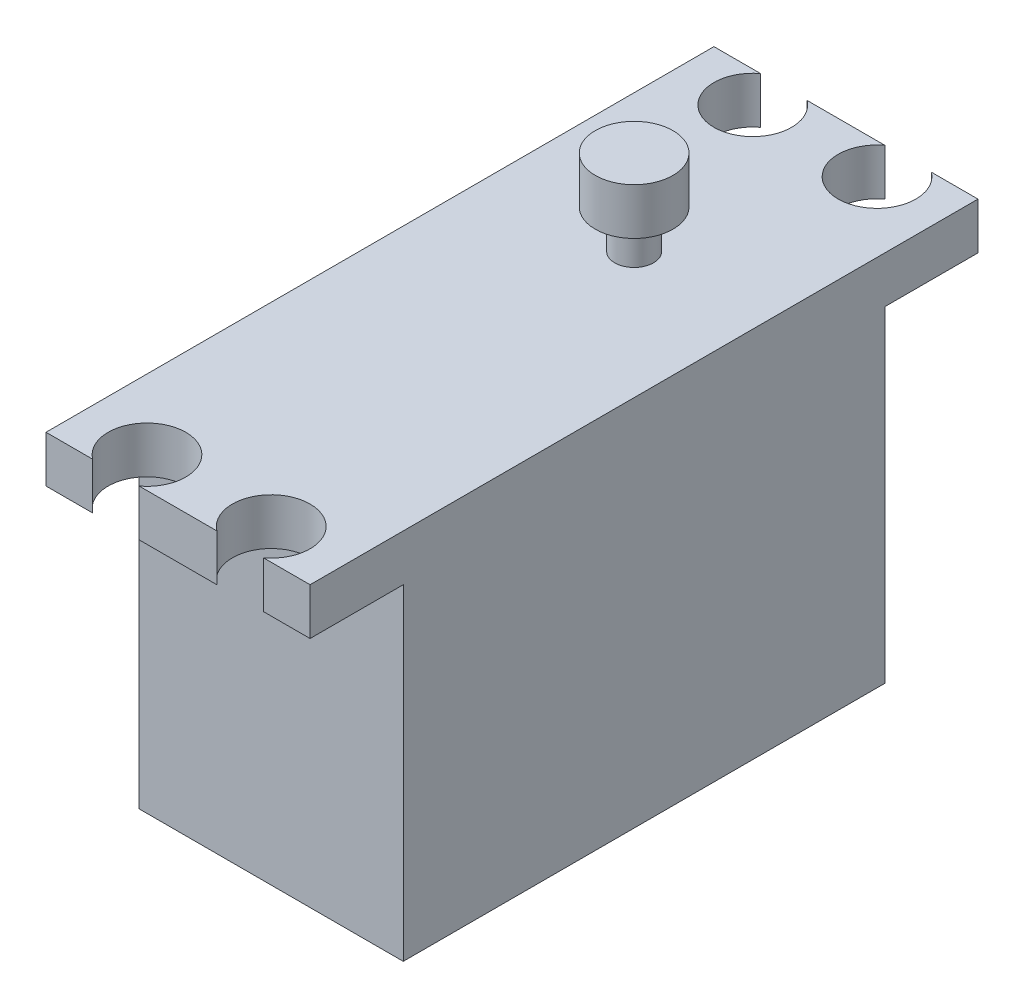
ISO-10303-21;
HEADER;
FILE_DESCRIPTION(('STEP AP214'),'2;1');
FILE_NAME('part.step','',(''),(''),'','','');
FILE_SCHEMA(('AUTOMOTIVE_DESIGN { 1 0 10303 214 1 1 1 1 }'));
ENDSEC;
DATA;
#1=APPLICATION_CONTEXT('core data for automotive mechanical design processes');
#2=APPLICATION_PROTOCOL_DEFINITION('international standard','automotive_design',2000,#1);
#3=PRODUCT_CONTEXT('',#1,'mechanical');
#4=PRODUCT('Part','Part','',(#3));
#5=PRODUCT_RELATED_PRODUCT_CATEGORY('part','',(#4));
#6=PRODUCT_DEFINITION_FORMATION('','',#4);
#7=PRODUCT_DEFINITION_CONTEXT('part definition',#1,'design');
#8=PRODUCT_DEFINITION('design','',#6,#7);
#9=PRODUCT_DEFINITION_SHAPE('','',#8);
#10=(LENGTH_UNIT() NAMED_UNIT(*) SI_UNIT(.MILLI.,.METRE.));
#11=(NAMED_UNIT(*) PLANE_ANGLE_UNIT() SI_UNIT($,.RADIAN.));
#12=(NAMED_UNIT(*) SI_UNIT($,.STERADIAN.) SOLID_ANGLE_UNIT());
#13=UNCERTAINTY_MEASURE_WITH_UNIT(LENGTH_MEASURE(1.E-05),#10,'distance_accuracy_value','');
#14=(GEOMETRIC_REPRESENTATION_CONTEXT(3) GLOBAL_UNCERTAINTY_ASSIGNED_CONTEXT((#13)) GLOBAL_UNIT_ASSIGNED_CONTEXT((#10,
#11,#12)) REPRESENTATION_CONTEXT('',''));
#15=CARTESIAN_POINT('',(0.,0.,0.));
#16=DIRECTION('',(0.,0.,1.));
#17=DIRECTION('',(1.,0.,0.));
#18=AXIS2_PLACEMENT_3D('',#15,#16,#17);
#19=CARTESIAN_POINT('',(8.86224165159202,29.5,8.));
#20=DIRECTION('',(0.,-1.,0.));
#21=DIRECTION('',(0.,0.,-1.));
#22=AXIS2_PLACEMENT_3D('',#19,#20,#21);
#23=CYLINDRICAL_SURFACE('',#22,1.25);
#24=CARTESIAN_POINT('',(8.86224165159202,24.,8.));
#25=DIRECTION('',(0.,1.,0.));
#26=DIRECTION('',(0.,0.,1.));
#27=AXIS2_PLACEMENT_3D('',#24,#25,#26);
#28=CIRCLE('',#27,1.25);
#29=CARTESIAN_POINT('',(8.86224165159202,24.,9.25));
#30=VERTEX_POINT('',#29);
#31=EDGE_CURVE('E298',#30,#30,#28,.T.);
#32=ORIENTED_EDGE('',*,*,#31,.T.);
#33=EDGE_LOOP('',(#32));
#34=FACE_BOUND('',#33,.T.);
#35=CARTESIAN_POINT('',(8.86224165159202,26.5,8.));
#36=DIRECTION('',(0.,1.,0.));
#37=DIRECTION('',(0.,0.,1.));
#38=AXIS2_PLACEMENT_3D('',#35,#36,#37);
#39=CIRCLE('',#38,1.25);
#40=CARTESIAN_POINT('',(8.86224165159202,26.5,9.25));
#41=VERTEX_POINT('',#40);
#42=EDGE_CURVE('E11',#41,#41,#39,.T.);
#43=ORIENTED_EDGE('',*,*,#42,.F.);
#44=EDGE_LOOP('',(#43));
#45=FACE_BOUND('',#44,.T.);
#46=ADVANCED_FACE('F32',(#34,#45),#23,.T.);
#47=CARTESIAN_POINT('',(17.,24.,-6.));
#48=DIRECTION('',(0.,0.,1.));
#49=DIRECTION('',(1.,0.,0.));
#50=AXIS2_PLACEMENT_3D('',#47,#48,#49);
#51=PLANE('',#50);
#52=DIRECTION('',(-1.,0.,0.));
#53=VECTOR('',#52,1.);
#54=CARTESIAN_POINT('',(17.,24.,-6.));
#55=LINE('',#54,#53);
#56=CARTESIAN_POINT('',(11.,24.,-6.));
#57=VERTEX_POINT('',#56);
#58=CARTESIAN_POINT('',(6.00000000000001,24.,-6.));
#59=VERTEX_POINT('',#58);
#60=EDGE_CURVE('E161',#57,#59,#55,.T.);
#61=ORIENTED_EDGE('',*,*,#60,.F.);
#62=DIRECTION('',(0.,-1.,0.));
#63=VECTOR('',#62,1.);
#64=CARTESIAN_POINT('',(11.,24.,-6.));
#65=LINE('',#64,#63);
#66=CARTESIAN_POINT('',(11.,21.,-6.));
#67=VERTEX_POINT('',#66);
#68=EDGE_CURVE('E289',#57,#67,#65,.T.);
#69=ORIENTED_EDGE('',*,*,#68,.T.);
#70=DIRECTION('',(-1.,0.,0.));
#71=VECTOR('',#70,1.);
#72=CARTESIAN_POINT('',(17.,21.,-6.));
#73=LINE('',#72,#71);
#74=CARTESIAN_POINT('',(6.00000000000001,21.,-6.));
#75=VERTEX_POINT('',#74);
#76=EDGE_CURVE('E163',#67,#75,#73,.T.);
#77=ORIENTED_EDGE('',*,*,#76,.T.);
#78=DIRECTION('',(0.,-1.,0.));
#79=VECTOR('',#78,1.);
#80=CARTESIAN_POINT('',(6.00000000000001,24.,-6.));
#81=LINE('',#80,#79);
#82=EDGE_CURVE('E147',#75,#59,#81,.F.);
#83=ORIENTED_EDGE('',*,*,#82,.T.);
#84=EDGE_LOOP('',(#61,#69,#77,#83));
#85=FACE_BOUND('',#84,.T.);
#86=ADVANCED_FACE('F159',(#85),#51,.F.);
#87=CARTESIAN_POINT('',(3.,24.,-6.));
#88=VERTEX_POINT('',#87);
#89=CARTESIAN_POINT('',(0.,24.,-6.));
#90=VERTEX_POINT('',#89);
#91=EDGE_CURVE('E170',#88,#90,#55,.T.);
#92=ORIENTED_EDGE('',*,*,#91,.F.);
#93=DIRECTION('',(0.,-1.,0.));
#94=VECTOR('',#93,1.);
#95=CARTESIAN_POINT('',(3.,24.,-6.));
#96=LINE('',#95,#94);
#97=CARTESIAN_POINT('',(3.,21.,-6.));
#98=VERTEX_POINT('',#97);
#99=EDGE_CURVE('E150',#88,#98,#96,.T.);
#100=ORIENTED_EDGE('',*,*,#99,.T.);
#101=CARTESIAN_POINT('',(0.,21.,-6.));
#102=VERTEX_POINT('',#101);
#103=EDGE_CURVE('E187',#98,#102,#73,.T.);
#104=ORIENTED_EDGE('',*,*,#103,.T.);
#105=DIRECTION('',(0.,-1.,0.));
#106=VECTOR('',#105,1.);
#107=CARTESIAN_POINT('',(0.,24.,-6.));
#108=LINE('',#107,#106);
#109=EDGE_CURVE('E206',#90,#102,#108,.T.);
#110=ORIENTED_EDGE('',*,*,#109,.F.);
#111=EDGE_LOOP('',(#92,#100,#104,#110));
#112=FACE_BOUND('',#111,.T.);
#113=ADVANCED_FACE('F338',(#112),#51,.F.);
#114=CARTESIAN_POINT('',(0.,24.,37.));
#115=DIRECTION('',(0.,0.,-1.));
#116=DIRECTION('',(-1.,0.,0.));
#117=AXIS2_PLACEMENT_3D('',#114,#115,#116);
#118=PLANE('',#117);
#119=DIRECTION('',(1.,0.,0.));
#120=VECTOR('',#119,1.);
#121=CARTESIAN_POINT('',(0.,24.,37.));
#122=LINE('',#121,#120);
#123=CARTESIAN_POINT('',(5.99999999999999,24.,37.));
#124=VERTEX_POINT('',#123);
#125=CARTESIAN_POINT('',(11.,24.,37.));
#126=VERTEX_POINT('',#125);
#127=EDGE_CURVE('E183',#124,#126,#122,.T.);
#128=ORIENTED_EDGE('',*,*,#127,.F.);
#129=DIRECTION('',(0.,-1.,0.));
#130=VECTOR('',#129,1.);
#131=CARTESIAN_POINT('',(5.99999999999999,24.,37.));
#132=LINE('',#131,#130);
#133=CARTESIAN_POINT('',(5.99999999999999,21.,37.));
#134=VERTEX_POINT('',#133);
#135=EDGE_CURVE('E55',#124,#134,#132,.T.);
#136=ORIENTED_EDGE('',*,*,#135,.T.);
#137=DIRECTION('',(1.,0.,0.));
#138=VECTOR('',#137,1.);
#139=CARTESIAN_POINT('',(0.,21.,37.));
#140=LINE('',#139,#138);
#141=CARTESIAN_POINT('',(11.,21.,37.));
#142=VERTEX_POINT('',#141);
#143=EDGE_CURVE('E200',#134,#142,#140,.T.);
#144=ORIENTED_EDGE('',*,*,#143,.T.);
#145=DIRECTION('',(0.,-1.,0.));
#146=VECTOR('',#145,1.);
#147=CARTESIAN_POINT('',(11.,24.,37.));
#148=LINE('',#147,#146);
#149=EDGE_CURVE('E286',#142,#126,#148,.F.);
#150=ORIENTED_EDGE('',*,*,#149,.T.);
#151=EDGE_LOOP('',(#128,#136,#144,#150));
#152=FACE_BOUND('',#151,.T.);
#153=ADVANCED_FACE('F360',(#152),#118,.F.);
#154=CARTESIAN_POINT('',(14.,24.,37.));
#155=VERTEX_POINT('',#154);
#156=CARTESIAN_POINT('',(17.,24.,37.));
#157=VERTEX_POINT('',#156);
#158=EDGE_CURVE('E178',#155,#157,#122,.T.);
#159=ORIENTED_EDGE('',*,*,#158,.F.);
#160=DIRECTION('',(0.,-1.,0.));
#161=VECTOR('',#160,1.);
#162=CARTESIAN_POINT('',(14.,24.,37.));
#163=LINE('',#162,#161);
#164=CARTESIAN_POINT('',(14.,21.,37.));
#165=VERTEX_POINT('',#164);
#166=EDGE_CURVE('E47',#155,#165,#163,.T.);
#167=ORIENTED_EDGE('',*,*,#166,.T.);
#168=CARTESIAN_POINT('',(17.,21.,37.));
#169=VERTEX_POINT('',#168);
#170=EDGE_CURVE('E196',#165,#169,#140,.T.);
#171=ORIENTED_EDGE('',*,*,#170,.T.);
#172=DIRECTION('',(0.,-1.,0.));
#173=VECTOR('',#172,1.);
#174=CARTESIAN_POINT('',(17.,24.,37.));
#175=LINE('',#174,#173);
#176=EDGE_CURVE('E182',#157,#169,#175,.T.);
#177=ORIENTED_EDGE('',*,*,#176,.F.);
#178=EDGE_LOOP('',(#159,#167,#171,#177));
#179=FACE_BOUND('',#178,.T.);
#180=ADVANCED_FACE('F361',(#179),#118,.F.);
#181=CARTESIAN_POINT('',(17.,21.,0.));
#182=DIRECTION('',(0.,0.,1.));
#183=DIRECTION('',(1.,0.,0.));
#184=AXIS2_PLACEMENT_3D('',#181,#182,#183);
#185=PLANE('',#184);
#186=DIRECTION('',(-1.,0.,0.));
#187=VECTOR('',#186,1.);
#188=CARTESIAN_POINT('',(17.,0.,0.));
#189=LINE('',#188,#187);
#190=CARTESIAN_POINT('',(17.,0.,0.));
#191=VERTEX_POINT('',#190);
#192=CARTESIAN_POINT('',(0.,0.,0.));
#193=VERTEX_POINT('',#192);
#194=EDGE_CURVE('E212',#191,#193,#189,.T.);
#195=ORIENTED_EDGE('',*,*,#194,.T.);
#196=DIRECTION('',(0.,-1.,0.));
#197=VECTOR('',#196,1.);
#198=CARTESIAN_POINT('',(0.,21.,0.));
#199=LINE('',#198,#197);
#200=CARTESIAN_POINT('',(0.,21.,0.));
#201=VERTEX_POINT('',#200);
#202=EDGE_CURVE('E40',#201,#193,#199,.T.);
#203=ORIENTED_EDGE('',*,*,#202,.F.);
#204=DIRECTION('',(-1.,0.,0.));
#205=VECTOR('',#204,1.);
#206=CARTESIAN_POINT('',(17.,21.,0.));
#207=LINE('',#206,#205);
#208=CARTESIAN_POINT('',(17.,21.,0.));
#209=VERTEX_POINT('',#208);
#210=EDGE_CURVE('E213',#209,#201,#207,.T.);
#211=ORIENTED_EDGE('',*,*,#210,.F.);
#212=DIRECTION('',(0.,-1.,0.));
#213=VECTOR('',#212,1.);
#214=CARTESIAN_POINT('',(17.,21.,0.));
#215=LINE('',#214,#213);
#216=EDGE_CURVE('E220',#209,#191,#215,.T.);
#217=ORIENTED_EDGE('',*,*,#216,.T.);
#218=EDGE_LOOP('',(#195,#203,#211,#217));
#219=FACE_BOUND('',#218,.T.);
#220=ADVANCED_FACE('F34',(#219),#185,.F.);
#221=CARTESIAN_POINT('',(0.,21.,0.));
#222=DIRECTION('',(1.,0.,0.));
#223=DIRECTION('',(0.,0.,-1.));
#224=AXIS2_PLACEMENT_3D('',#221,#222,#223);
#225=PLANE('',#224);
#226=DIRECTION('',(0.,0.,1.));
#227=VECTOR('',#226,1.);
#228=CARTESIAN_POINT('',(0.,0.,0.));
#229=LINE('',#228,#227);
#230=CARTESIAN_POINT('',(0.,0.,31.));
#231=VERTEX_POINT('',#230);
#232=EDGE_CURVE('E223',#193,#231,#229,.T.);
#233=ORIENTED_EDGE('',*,*,#232,.T.);
#234=DIRECTION('',(0.,-1.,0.));
#235=VECTOR('',#234,1.);
#236=CARTESIAN_POINT('',(0.,21.,31.));
#237=LINE('',#236,#235);
#238=CARTESIAN_POINT('',(0.,21.,31.));
#239=VERTEX_POINT('',#238);
#240=EDGE_CURVE('E233',#239,#231,#237,.T.);
#241=ORIENTED_EDGE('',*,*,#240,.F.);
#242=DIRECTION('',(0.,0.,1.));
#243=VECTOR('',#242,1.);
#244=CARTESIAN_POINT('',(0.,21.,-6.));
#245=LINE('',#244,#243);
#246=CARTESIAN_POINT('',(0.,21.,37.));
#247=VERTEX_POINT('',#246);
#248=EDGE_CURVE('E192',#239,#247,#245,.T.);
#249=ORIENTED_EDGE('',*,*,#248,.T.);
#250=DIRECTION('',(0.,-1.,0.));
#251=VECTOR('',#250,1.);
#252=CARTESIAN_POINT('',(0.,24.,37.));
#253=LINE('',#252,#251);
#254=CARTESIAN_POINT('',(0.,24.,37.));
#255=VERTEX_POINT('',#254);
#256=EDGE_CURVE('E203',#255,#247,#253,.T.);
#257=ORIENTED_EDGE('',*,*,#256,.F.);
#258=DIRECTION('',(0.,0.,1.));
#259=VECTOR('',#258,1.);
#260=CARTESIAN_POINT('',(0.,24.,-6.));
#261=LINE('',#260,#259);
#262=EDGE_CURVE('E172',#90,#255,#261,.T.);
#263=ORIENTED_EDGE('',*,*,#262,.F.);
#264=ORIENTED_EDGE('',*,*,#109,.T.);
#265=EDGE_CURVE('E193',#102,#201,#245,.T.);
#266=ORIENTED_EDGE('',*,*,#265,.T.);
#267=ORIENTED_EDGE('',*,*,#202,.T.);
#268=EDGE_LOOP('',(#233,#241,#249,#257,#263,#264,#266,#267));
#269=FACE_BOUND('',#268,.T.);
#270=ADVANCED_FACE('F237',(#269),#225,.F.);
#271=CARTESIAN_POINT('',(0.,21.,31.));
#272=DIRECTION('',(0.,0.,-1.));
#273=DIRECTION('',(-1.,0.,0.));
#274=AXIS2_PLACEMENT_3D('',#271,#272,#273);
#275=PLANE('',#274);
#276=DIRECTION('',(1.,0.,0.));
#277=VECTOR('',#276,1.);
#278=CARTESIAN_POINT('',(0.,0.,31.));
#279=LINE('',#278,#277);
#280=CARTESIAN_POINT('',(17.,0.,31.));
#281=VERTEX_POINT('',#280);
#282=EDGE_CURVE('E225',#231,#281,#279,.T.);
#283=ORIENTED_EDGE('',*,*,#282,.T.);
#284=DIRECTION('',(0.,-1.,0.));
#285=VECTOR('',#284,1.);
#286=CARTESIAN_POINT('',(17.,21.,31.));
#287=LINE('',#286,#285);
#288=CARTESIAN_POINT('',(17.,21.,31.));
#289=VERTEX_POINT('',#288);
#290=EDGE_CURVE('E230',#289,#281,#287,.T.);
#291=ORIENTED_EDGE('',*,*,#290,.F.);
#292=DIRECTION('',(1.,0.,0.));
#293=VECTOR('',#292,1.);
#294=CARTESIAN_POINT('',(0.,21.,31.));
#295=LINE('',#294,#293);
#296=EDGE_CURVE('E216',#239,#289,#295,.T.);
#297=ORIENTED_EDGE('',*,*,#296,.F.);
#298=ORIENTED_EDGE('',*,*,#240,.T.);
#299=EDGE_LOOP('',(#283,#291,#297,#298));
#300=FACE_BOUND('',#299,.T.);
#301=ADVANCED_FACE('F247',(#300),#275,.F.);
#302=CARTESIAN_POINT('',(17.,21.,31.));
#303=DIRECTION('',(-1.,0.,0.));
#304=DIRECTION('',(0.,0.,1.));
#305=AXIS2_PLACEMENT_3D('',#302,#303,#304);
#306=PLANE('',#305);
#307=DIRECTION('',(0.,0.,-1.));
#308=VECTOR('',#307,1.);
#309=CARTESIAN_POINT('',(17.,0.,31.));
#310=LINE('',#309,#308);
#311=EDGE_CURVE('E217',#281,#191,#310,.T.);
#312=ORIENTED_EDGE('',*,*,#311,.T.);
#313=ORIENTED_EDGE('',*,*,#216,.F.);
#314=DIRECTION('',(0.,0.,-1.));
#315=VECTOR('',#314,1.);
#316=CARTESIAN_POINT('',(17.,21.,37.));
#317=LINE('',#316,#315);
#318=CARTESIAN_POINT('',(17.,21.,-6.));
#319=VERTEX_POINT('',#318);
#320=EDGE_CURVE('E188',#209,#319,#317,.T.);
#321=ORIENTED_EDGE('',*,*,#320,.T.);
#322=DIRECTION('',(0.,-1.,0.));
#323=VECTOR('',#322,1.);
#324=CARTESIAN_POINT('',(17.,24.,-6.));
#325=LINE('',#324,#323);
#326=CARTESIAN_POINT('',(17.,24.,-6.));
#327=VERTEX_POINT('',#326);
#328=EDGE_CURVE('E209',#327,#319,#325,.T.);
#329=ORIENTED_EDGE('',*,*,#328,.F.);
#330=DIRECTION('',(0.,0.,-1.));
#331=VECTOR('',#330,1.);
#332=CARTESIAN_POINT('',(17.,24.,37.));
#333=LINE('',#332,#331);
#334=EDGE_CURVE('E173',#157,#327,#333,.T.);
#335=ORIENTED_EDGE('',*,*,#334,.F.);
#336=ORIENTED_EDGE('',*,*,#176,.T.);
#337=EDGE_CURVE('E184',#169,#289,#317,.T.);
#338=ORIENTED_EDGE('',*,*,#337,.T.);
#339=ORIENTED_EDGE('',*,*,#290,.T.);
#340=EDGE_LOOP('',(#312,#313,#321,#329,#335,#336,#338,#339));
#341=FACE_BOUND('',#340,.T.);
#342=ADVANCED_FACE('F250',(#341),#306,.F.);
#343=CARTESIAN_POINT('',(0.,0.,0.));
#344=DIRECTION('',(0.,1.,0.));
#345=DIRECTION('',(0.,0.,1.));
#346=AXIS2_PLACEMENT_3D('',#343,#344,#345);
#347=PLANE('',#346);
#348=ORIENTED_EDGE('',*,*,#194,.F.);
#349=ORIENTED_EDGE('',*,*,#311,.F.);
#350=ORIENTED_EDGE('',*,*,#282,.F.);
#351=ORIENTED_EDGE('',*,*,#232,.F.);
#352=EDGE_LOOP('',(#348,#349,#350,#351));
#353=FACE_BOUND('',#352,.T.);
#354=ADVANCED_FACE('F244',(#353),#347,.F.);
#355=CARTESIAN_POINT('',(0.,21.,0.));
#356=DIRECTION('',(0.,1.,0.));
#357=DIRECTION('',(0.,0.,1.));
#358=AXIS2_PLACEMENT_3D('',#355,#356,#357);
#359=PLANE('',#358);
#360=ORIENTED_EDGE('',*,*,#76,.F.);
#361=CARTESIAN_POINT('',(12.5,21.,-4.));
#362=DIRECTION('',(0.,-1.,0.));
#363=DIRECTION('',(0.,0.,-1.));
#364=AXIS2_PLACEMENT_3D('',#361,#362,#363);
#365=CIRCLE('',#364,2.5);
#366=CARTESIAN_POINT('',(14.,21.,-6.));
#367=VERTEX_POINT('',#366);
#368=EDGE_CURVE('E304',#367,#67,#365,.T.);
#369=ORIENTED_EDGE('',*,*,#368,.F.);
#370=EDGE_CURVE('E189',#319,#367,#73,.T.);
#371=ORIENTED_EDGE('',*,*,#370,.F.);
#372=ORIENTED_EDGE('',*,*,#320,.F.);
#373=ORIENTED_EDGE('',*,*,#210,.T.);
#374=ORIENTED_EDGE('',*,*,#265,.F.);
#375=ORIENTED_EDGE('',*,*,#103,.F.);
#376=CARTESIAN_POINT('',(4.5,21.,-4.));
#377=DIRECTION('',(0.,-1.,0.));
#378=DIRECTION('',(0.,0.,-1.));
#379=AXIS2_PLACEMENT_3D('',#376,#377,#378);
#380=CIRCLE('',#379,2.5);
#381=EDGE_CURVE('E154',#75,#98,#380,.T.);
#382=ORIENTED_EDGE('',*,*,#381,.F.);
#383=EDGE_LOOP('',(#360,#369,#371,#372,#373,#374,#375,#382));
#384=FACE_BOUND('',#383,.T.);
#385=ADVANCED_FACE('F276',(#384),#359,.F.);
#386=ORIENTED_EDGE('',*,*,#143,.F.);
#387=CARTESIAN_POINT('',(4.5,21.,35.));
#388=DIRECTION('',(0.,-1.,0.));
#389=DIRECTION('',(0.,0.,1.));
#390=AXIS2_PLACEMENT_3D('',#387,#388,#389);
#391=CIRCLE('',#390,2.5);
#392=CARTESIAN_POINT('',(3.,21.,37.));
#393=VERTEX_POINT('',#392);
#394=EDGE_CURVE('E296',#393,#134,#391,.T.);
#395=ORIENTED_EDGE('',*,*,#394,.F.);
#396=EDGE_CURVE('E197',#247,#393,#140,.T.);
#397=ORIENTED_EDGE('',*,*,#396,.F.);
#398=ORIENTED_EDGE('',*,*,#248,.F.);
#399=ORIENTED_EDGE('',*,*,#296,.T.);
#400=ORIENTED_EDGE('',*,*,#337,.F.);
#401=ORIENTED_EDGE('',*,*,#170,.F.);
#402=CARTESIAN_POINT('',(12.5,21.,35.));
#403=DIRECTION('',(0.,-1.,0.));
#404=DIRECTION('',(0.,0.,1.));
#405=AXIS2_PLACEMENT_3D('',#402,#403,#404);
#406=CIRCLE('',#405,2.5);
#407=EDGE_CURVE('E300',#142,#165,#406,.T.);
#408=ORIENTED_EDGE('',*,*,#407,.F.);
#409=EDGE_LOOP('',(#386,#395,#397,#398,#399,#400,#401,#408));
#410=FACE_BOUND('',#409,.T.);
#411=ADVANCED_FACE('F257',(#410),#359,.F.);
#412=ORIENTED_EDGE('',*,*,#370,.T.);
#413=DIRECTION('',(0.,-1.,0.));
#414=VECTOR('',#413,1.);
#415=CARTESIAN_POINT('',(14.,24.,-6.));
#416=LINE('',#415,#414);
#417=CARTESIAN_POINT('',(14.,24.,-6.));
#418=VERTEX_POINT('',#417);
#419=EDGE_CURVE('E291',#367,#418,#416,.F.);
#420=ORIENTED_EDGE('',*,*,#419,.T.);
#421=EDGE_CURVE('E169',#327,#418,#55,.T.);
#422=ORIENTED_EDGE('',*,*,#421,.F.);
#423=ORIENTED_EDGE('',*,*,#328,.T.);
#424=EDGE_LOOP('',(#412,#420,#422,#423));
#425=FACE_BOUND('',#424,.T.);
#426=ADVANCED_FACE('F340',(#425),#51,.F.);
#427=ORIENTED_EDGE('',*,*,#396,.T.);
#428=DIRECTION('',(0.,-1.,0.));
#429=VECTOR('',#428,1.);
#430=CARTESIAN_POINT('',(3.,24.,37.));
#431=LINE('',#430,#429);
#432=CARTESIAN_POINT('',(3.,24.,37.));
#433=VERTEX_POINT('',#432);
#434=EDGE_CURVE('E268',#393,#433,#431,.F.);
#435=ORIENTED_EDGE('',*,*,#434,.T.);
#436=EDGE_CURVE('E179',#255,#433,#122,.T.);
#437=ORIENTED_EDGE('',*,*,#436,.F.);
#438=ORIENTED_EDGE('',*,*,#256,.T.);
#439=EDGE_LOOP('',(#427,#435,#437,#438));
#440=FACE_BOUND('',#439,.T.);
#441=ADVANCED_FACE('F266',(#440),#118,.F.);
#442=CARTESIAN_POINT('',(0.,24.,0.));
#443=DIRECTION('',(0.,1.,0.));
#444=DIRECTION('',(0.,0.,1.));
#445=AXIS2_PLACEMENT_3D('',#442,#443,#444);
#446=PLANE('',#445);
#447=ORIENTED_EDGE('',*,*,#31,.F.);
#448=EDGE_LOOP('',(#447));
#449=FACE_BOUND('',#448,.T.);
#450=CARTESIAN_POINT('',(4.5,24.,35.));
#451=DIRECTION('',(0.,-1.,0.));
#452=DIRECTION('',(0.,0.,1.));
#453=AXIS2_PLACEMENT_3D('',#450,#451,#452);
#454=CIRCLE('',#453,2.5);
#455=EDGE_CURVE('E270',#433,#124,#454,.T.);
#456=ORIENTED_EDGE('',*,*,#455,.T.);
#457=ORIENTED_EDGE('',*,*,#127,.T.);
#458=CARTESIAN_POINT('',(12.5,24.,35.));
#459=DIRECTION('',(0.,-1.,0.));
#460=DIRECTION('',(0.,0.,1.));
#461=AXIS2_PLACEMENT_3D('',#458,#459,#460);
#462=CIRCLE('',#461,2.5);
#463=EDGE_CURVE('E302',#126,#155,#462,.T.);
#464=ORIENTED_EDGE('',*,*,#463,.T.);
#465=ORIENTED_EDGE('',*,*,#158,.T.);
#466=ORIENTED_EDGE('',*,*,#334,.T.);
#467=ORIENTED_EDGE('',*,*,#421,.T.);
#468=CARTESIAN_POINT('',(12.5,24.,-4.));
#469=DIRECTION('',(0.,-1.,0.));
#470=DIRECTION('',(0.,0.,-1.));
#471=AXIS2_PLACEMENT_3D('',#468,#469,#470);
#472=CIRCLE('',#471,2.5);
#473=EDGE_CURVE('E168',#418,#57,#472,.T.);
#474=ORIENTED_EDGE('',*,*,#473,.T.);
#475=ORIENTED_EDGE('',*,*,#60,.T.);
#476=CARTESIAN_POINT('',(4.5,24.,-4.));
#477=DIRECTION('',(0.,-1.,0.));
#478=DIRECTION('',(0.,0.,-1.));
#479=AXIS2_PLACEMENT_3D('',#476,#477,#478);
#480=CIRCLE('',#479,2.5);
#481=EDGE_CURVE('E144',#59,#88,#480,.T.);
#482=ORIENTED_EDGE('',*,*,#481,.T.);
#483=ORIENTED_EDGE('',*,*,#91,.T.);
#484=ORIENTED_EDGE('',*,*,#262,.T.);
#485=ORIENTED_EDGE('',*,*,#436,.T.);
#486=EDGE_LOOP('',(#456,#457,#464,#465,#466,#467,#474,#475,#482,#483,#484,#485));
#487=FACE_BOUND('',#486,.T.);
#488=ADVANCED_FACE('F166',(#449,#487),#446,.T.);
#489=CARTESIAN_POINT('',(4.5,24.,-4.));
#490=DIRECTION('',(0.,-1.,0.));
#491=DIRECTION('',(0.,0.,-1.));
#492=AXIS2_PLACEMENT_3D('',#489,#490,#491);
#493=CYLINDRICAL_SURFACE('',#492,2.5);
#494=ORIENTED_EDGE('',*,*,#481,.F.);
#495=ORIENTED_EDGE('',*,*,#82,.F.);
#496=ORIENTED_EDGE('',*,*,#381,.T.);
#497=ORIENTED_EDGE('',*,*,#99,.F.);
#498=EDGE_LOOP('',(#494,#495,#496,#497));
#499=FACE_BOUND('',#498,.T.);
#500=ADVANCED_FACE('F146',(#499),#493,.F.);
#501=CARTESIAN_POINT('',(12.5,24.,-4.));
#502=DIRECTION('',(0.,-1.,0.));
#503=DIRECTION('',(0.,0.,-1.));
#504=AXIS2_PLACEMENT_3D('',#501,#502,#503);
#505=CYLINDRICAL_SURFACE('',#504,2.5);
#506=ORIENTED_EDGE('',*,*,#473,.F.);
#507=ORIENTED_EDGE('',*,*,#419,.F.);
#508=ORIENTED_EDGE('',*,*,#368,.T.);
#509=ORIENTED_EDGE('',*,*,#68,.F.);
#510=EDGE_LOOP('',(#506,#507,#508,#509));
#511=FACE_BOUND('',#510,.T.);
#512=ADVANCED_FACE('F343',(#511),#505,.F.);
#513=CARTESIAN_POINT('',(12.5,24.,35.));
#514=DIRECTION('',(0.,-1.,0.));
#515=DIRECTION('',(0.,0.,-1.));
#516=AXIS2_PLACEMENT_3D('',#513,#514,#515);
#517=CYLINDRICAL_SURFACE('',#516,2.5);
#518=ORIENTED_EDGE('',*,*,#463,.F.);
#519=ORIENTED_EDGE('',*,*,#149,.F.);
#520=ORIENTED_EDGE('',*,*,#407,.T.);
#521=ORIENTED_EDGE('',*,*,#166,.F.);
#522=EDGE_LOOP('',(#518,#519,#520,#521));
#523=FACE_BOUND('',#522,.T.);
#524=ADVANCED_FACE('F346',(#523),#517,.F.);
#525=CARTESIAN_POINT('',(4.5,24.,35.));
#526=DIRECTION('',(0.,-1.,0.));
#527=DIRECTION('',(0.,0.,-1.));
#528=AXIS2_PLACEMENT_3D('',#525,#526,#527);
#529=CYLINDRICAL_SURFACE('',#528,2.5);
#530=ORIENTED_EDGE('',*,*,#455,.F.);
#531=ORIENTED_EDGE('',*,*,#434,.F.);
#532=ORIENTED_EDGE('',*,*,#394,.T.);
#533=ORIENTED_EDGE('',*,*,#135,.F.);
#534=EDGE_LOOP('',(#530,#531,#532,#533));
#535=FACE_BOUND('',#534,.T.);
#536=ADVANCED_FACE('F330',(#535),#529,.F.);
#537=CARTESIAN_POINT('',(8.86224165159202,26.5,8.));
#538=DIRECTION('',(0.,1.,0.));
#539=DIRECTION('',(0.,0.,1.));
#540=AXIS2_PLACEMENT_3D('',#537,#538,#539);
#541=CYLINDRICAL_SURFACE('',#540,2.5);
#542=CARTESIAN_POINT('',(8.86224165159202,26.5,8.));
#543=DIRECTION('',(0.,1.,0.));
#544=DIRECTION('',(0.,0.,1.));
#545=AXIS2_PLACEMENT_3D('',#542,#543,#544);
#546=CIRCLE('',#545,2.5);
#547=CARTESIAN_POINT('',(8.86224165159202,26.5,10.5));
#548=VERTEX_POINT('',#547);
#549=EDGE_CURVE('E309',#548,#548,#546,.T.);
#550=ORIENTED_EDGE('',*,*,#549,.T.);
#551=EDGE_LOOP('',(#550));
#552=FACE_BOUND('',#551,.T.);
#553=CARTESIAN_POINT('',(8.86224165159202,29.5,8.));
#554=DIRECTION('',(0.,1.,0.));
#555=DIRECTION('',(0.,0.,1.));
#556=AXIS2_PLACEMENT_3D('',#553,#554,#555);
#557=CIRCLE('',#556,2.5);
#558=CARTESIAN_POINT('',(8.86224165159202,29.5,10.5));
#559=VERTEX_POINT('',#558);
#560=EDGE_CURVE('E310',#559,#559,#557,.T.);
#561=ORIENTED_EDGE('',*,*,#560,.F.);
#562=EDGE_LOOP('',(#561));
#563=FACE_BOUND('',#562,.T.);
#564=ADVANCED_FACE('F316',(#552,#563),#541,.T.);
#565=CARTESIAN_POINT('',(8.86224165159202,26.5,8.));
#566=DIRECTION('',(0.,1.,0.));
#567=DIRECTION('',(0.,0.,1.));
#568=AXIS2_PLACEMENT_3D('',#565,#566,#567);
#569=PLANE('',#568);
#570=ORIENTED_EDGE('',*,*,#42,.T.);
#571=EDGE_LOOP('',(#570));
#572=FACE_BOUND('',#571,.T.);
#573=ORIENTED_EDGE('',*,*,#549,.F.);
#574=EDGE_LOOP('',(#573));
#575=FACE_BOUND('',#574,.T.);
#576=ADVANCED_FACE('F319',(#572,#575),#569,.F.);
#577=CARTESIAN_POINT('',(8.86224165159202,29.5,8.));
#578=DIRECTION('',(0.,1.,0.));
#579=DIRECTION('',(0.,0.,1.));
#580=AXIS2_PLACEMENT_3D('',#577,#578,#579);
#581=PLANE('',#580);
#582=ORIENTED_EDGE('',*,*,#560,.T.);
#583=EDGE_LOOP('',(#582));
#584=FACE_BOUND('',#583,.T.);
#585=ADVANCED_FACE('F321',(#584),#581,.T.);
#586=CLOSED_SHELL('',(#46,#86,#113,#153,#180,#220,#270,#301,#342,#354,#385,#411,#426,#441,#488,
#500,#512,#524,#536,#564,#576,#585));
#587=MANIFOLD_SOLID_BREP('B2',#586);
#588=ADVANCED_BREP_SHAPE_REPRESENTATION('',(#18,#587),#14);
#589=SHAPE_DEFINITION_REPRESENTATION(#9,#588);
ENDSEC;
END-ISO-10303-21;
